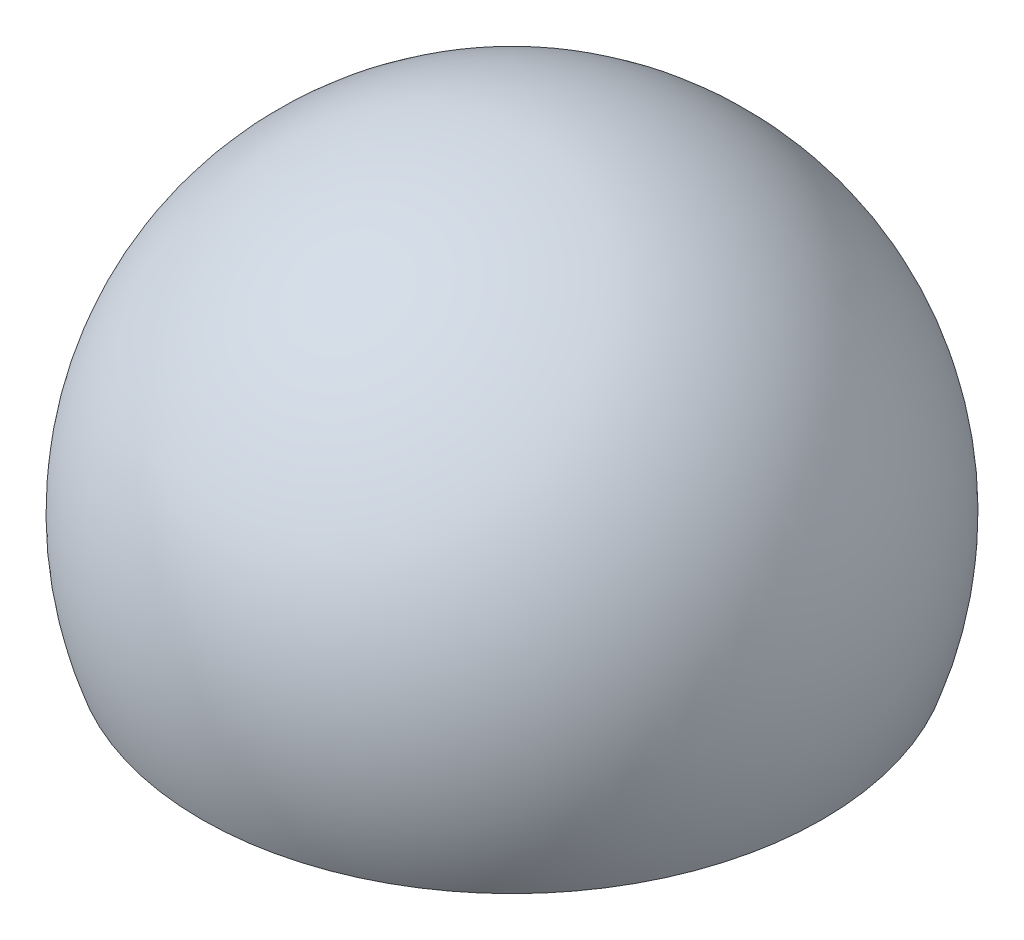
from build123d import *

# Parameters (mm, degrees)
TRUNCATED_BALL_DEPTH      = 11.998522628
TRUNCATED_BALL_DEPTH_BACK = 11.998522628
SKETCH3_R                 = 4.1275
RECESSED_DEPTH            = 0.127
SKETCH4_R                 = 2.4765
THREADED_DEPTH            = 6.35
CHAMFER2_SIZE             = 0.6985


with BuildPart() as part:
    # Sketch1 → Complete_Ball (revolve)
    with BuildSketch(Plane.XY):
        with BuildLine():
            Line((0, 6.35), (0, -6.35))
            ThreePointArc((0, -6.35), (6.35, 0), (0, 6.35))
        make_face()
    revolve(axis=Axis((0, 6.77418, 0), (0, -1, 0)))

    # Sketch2 → Truncated_ball (cut, two sides: drawn at the far end of the back side and taken through both)
    with BuildSketch(Plane.XY.offset(-TRUNCATED_BALL_DEPTH_BACK)):
        with BuildLine():
            Line((-5.980823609, -2.1336), (5.980823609, -2.1336))
            ThreePointArc((5.980823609, -2.1336), (0, -6.35), (-5.980823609, -2.1336))
        make_face()
    extrude(amount=TRUNCATED_BALL_DEPTH + TRUNCATED_BALL_DEPTH_BACK, mode=Mode.SUBTRACT)

    # Sketch3 → Recessed (cut)
    with BuildSketch(Plane.XZ.offset(2.1336)):
        with Locations(Location((0, 0, 0), (0, 0, 270))):
            Circle(SKETCH3_R)
    extrude(amount=-RECESSED_DEPTH, mode=Mode.SUBTRACT)

    # Sketch4 → Threaded (cut)
    with BuildSketch(Plane.XZ.offset(2.0066)):
        with Locations(Location((0, 0, 0), (0, 0, 270))):
            Circle(SKETCH4_R)
    extrude(amount=-THREADED_DEPTH, mode=Mode.SUBTRACT)

    # Chamfer2
    chamfer2_edges = [part.edges().sort_by_distance(p)[0] for p in [
        (0, -2.0066, 2.4765),
    ]]
    chamfer(chamfer2_edges, length=CHAMFER2_SIZE)


solid = part.part
